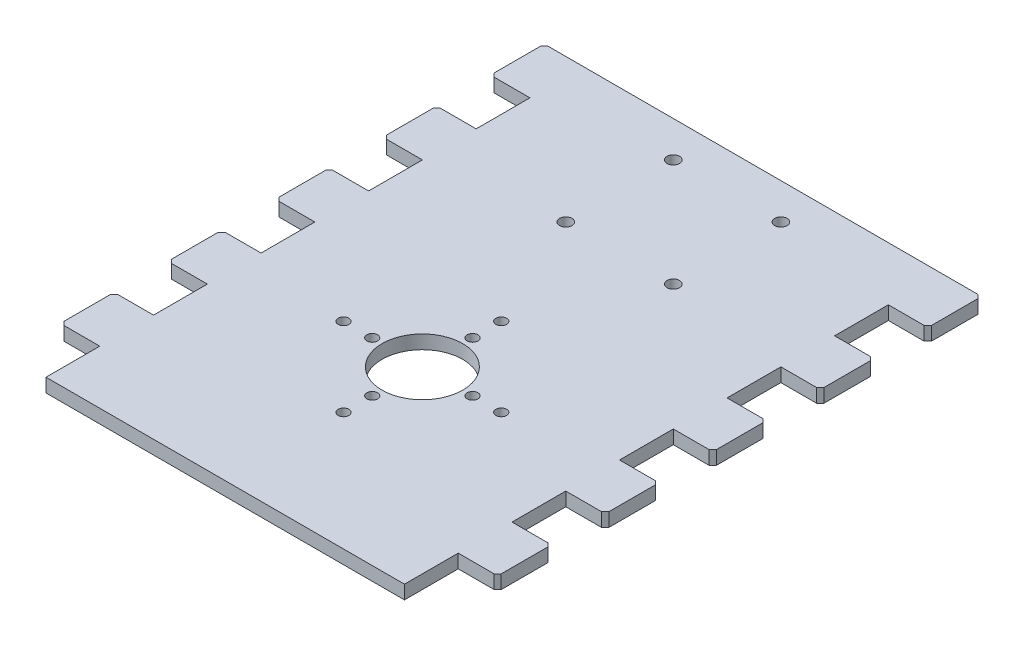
from build123d import *

# Parameters (mm, degrees)
PANEL_W             = 100
PANEL_H             = 150
PANEL_R             = 11.25
PANEL_R_2           = 1.5
PANEL_R_3           = 1.75
PANELX_DEPTH        = 3.81
TABS_W              = 11
TABS_H              = 15
BOSS_EXTRUDE2_DEPTH = 3.81
CHAMFER1_SIZE       = 1


with BuildPart() as part:
    # panel → panelx (new body)
    with BuildSketch(Plane(origin=(0, 0, 0), x_dir=(1, 0, 0), z_dir=(0, 1, 0))):
        with Locations((50, 75)):
            Rectangle(PANEL_W, PANEL_H)
        with Locations(Location((50, 55, 0), (0, 0, 270))):
            Circle(PANEL_R, mode=Mode.SUBTRACT)
        with Locations(Location((50, 69, 0), (0, 0, 270))):
            Circle(PANEL_R_2, mode=Mode.SUBTRACT)
        with Locations(Location((50, 77, 0), (0, 0, 270))):
            Circle(PANEL_R_2, mode=Mode.SUBTRACT)
        with Locations(Location((64, 55, 0), (0, 0, 270))):
            Circle(PANEL_R_2, mode=Mode.SUBTRACT)
        with Locations(Location((72, 55, 0), (0, 0, 270))):
            Circle(PANEL_R_2, mode=Mode.SUBTRACT)
        with Locations(Location((50, 41, 0), (0, 0, 270))):
            Circle(PANEL_R_2, mode=Mode.SUBTRACT)
        with Locations(Location((50, 33, 0), (0, 0, 270))):
            Circle(PANEL_R_2, mode=Mode.SUBTRACT)
        with Locations(Location((36, 55, 0), (0, 0, 270))):
            Circle(PANEL_R_2, mode=Mode.SUBTRACT)
        with Locations(Location((28, 55, 0), (0, 0, 270))):
            Circle(PANEL_R_2, mode=Mode.SUBTRACT)
        with Locations(Location((35, 140, 0), (0, 0, 270))):
            Circle(PANEL_R_3, mode=Mode.SUBTRACT)
        with Locations(Location((65, 140, 0), (0, 0, 270))):
            Circle(PANEL_R_3, mode=Mode.SUBTRACT)
        with Locations(Location((65, 110, 0), (0, 0, 270))):
            Circle(PANEL_R_3, mode=Mode.SUBTRACT)
        with Locations(Location((35, 110, 0), (0, 0, 270))):
            Circle(PANEL_R_3, mode=Mode.SUBTRACT)
    extrude(amount=PANELX_DEPTH)

    # tabs → Boss-Extrude2 (add)
    with BuildSketch(Plane(origin=(0, 3.81, 0), x_dir=(1, 0, 0), z_dir=(0, 1, 0))):
        with Locations((-5.5, 142.5)):
            Rectangle(TABS_W, TABS_H)
        with Locations((105.5, 142.5)):
            Rectangle(TABS_W, TABS_H)
        with Locations((-5.5, 112.5)):
            Rectangle(TABS_W, TABS_H)
        with Locations((105.5, 112.5)):
            Rectangle(TABS_W, TABS_H)
        with Locations((-5.5, 82.5)):
            Rectangle(TABS_W, TABS_H)
        with Locations((105.5, 82.5)):
            Rectangle(TABS_W, TABS_H)
        with Locations((-5.5, 52.5)):
            Rectangle(TABS_W, TABS_H)
        with Locations((105.5, 52.5)):
            Rectangle(TABS_W, TABS_H)
        with Locations((-5.5, 22.5)):
            Rectangle(TABS_W, TABS_H)
        with Locations((105.5, 22.5)):
            Rectangle(TABS_W, TABS_H)
    extrude(amount=-BOSS_EXTRUDE2_DEPTH)

    # Chamfer1
    chamfer1_edges = [part.edges().sort_by_distance(p)[0] for p in [
        (-11, 1.905, -105),
        (-11, 1.905, -120),
        (111, 1.905, -75),
        (111, 1.905, -90),
        (-11, 1.905, -75),
        (-11, 1.905, -90),
        (111, 1.905, -45),
        (111, 1.905, -60),
        (-11, 1.905, -45),
        (-11, 1.905, -60),
        (111, 1.905, -15),
        (111, 1.905, -30),
        (-11, 1.905, -15),
        (-11, 1.905, -30),
        (111, 1.905, -135),
        (111, 1.905, -150),
        (-11, 1.905, -135),
        (-11, 1.905, -150),
        (111, 1.905, -105),
        (111, 1.905, -120),
    ]]
    chamfer(chamfer1_edges, length=CHAMFER1_SIZE)


solid = part.part
